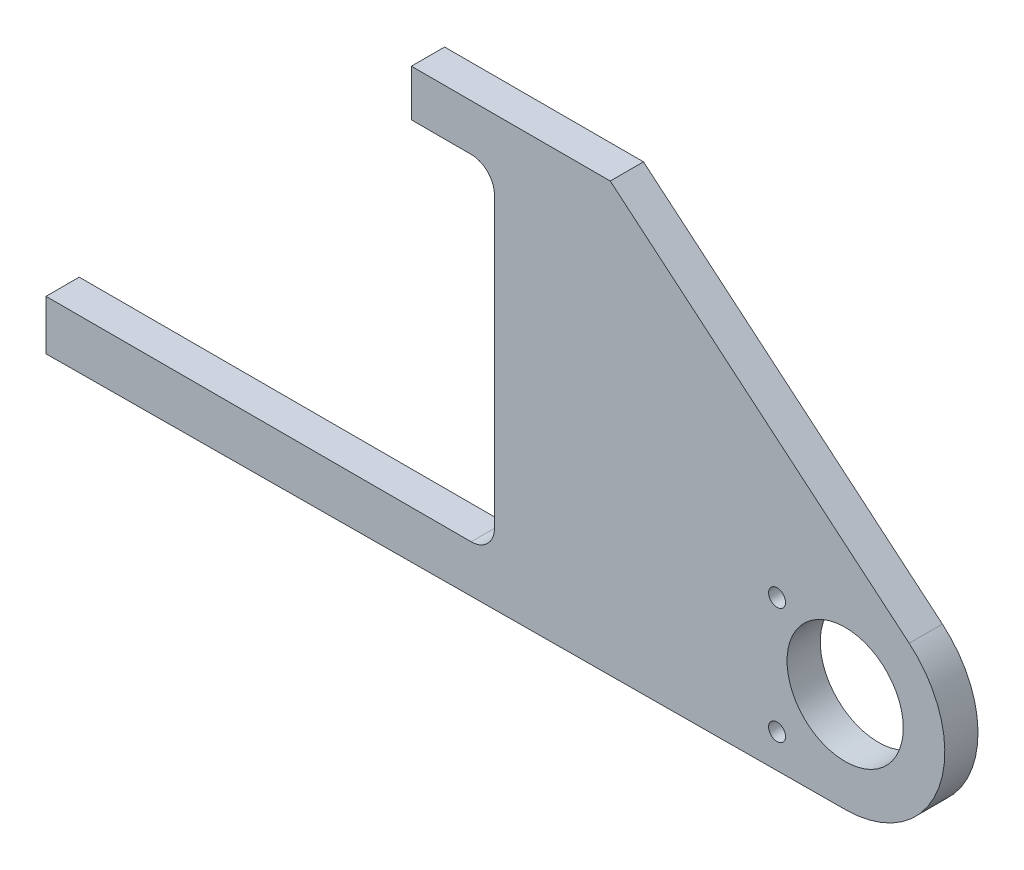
from build123d import *

# Parameters (mm, degrees)
ESQUISSE1_R            = 35
EXTRUSION1_DEPTH       = 20
TROU_TARAUD_M121_D     = 10.2
TROU_TARAUD_M121_DEPTH = 29.25
TROU_TARAUD_M121_TIP   = 3.064389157


with BuildPart() as part:
    # Esquisse1 → Extrusion1 (new body)
    with BuildSketch(Plane.XY):
        with BuildLine():
            Line((-481.18, -33), (-225.18, -33))
            ThreePointArc((-225.18, -33), (-215.280505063, -28.899494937), (-211.18, -19))
            Line((-211.18, -19), (-211.18, 155))
            ThreePointArc((-211.18, 155), (-215.280505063, 164.899494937), (-225.18, 169))
            Line((-225.18, 169), (-261.18, 169))
            Line((-261.18, 169), (-261.18, 197))
            Line((-261.18, 197), (-141.432028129, 197))
            Line((-141.432028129, 197), (38.567256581, 45.962666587))
            ThreePointArc((38.567256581, 45.962666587), (56.445229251, -20.345419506), (0.373927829, -59.998834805))
            Line((0.373927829, -59.998834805), (-481.18, -63))
            Line((-481.18, -63), (-481.18, -33))
        make_face()
        Circle(ESQUISSE1_R, mode=Mode.SUBTRACT)
    extrude(amount=EXTRUSION1_DEPTH)

    # Trou taraud_ M121
    with Locations(Plane.XY.offset(20)):
        with Locations((-41, 30), (-41, -40)):
            Hole(TROU_TARAUD_M121_D / 2, depth=TROU_TARAUD_M121_DEPTH)
            with Locations((0, 0, -(TROU_TARAUD_M121_DEPTH + TROU_TARAUD_M121_TIP / 2))):  # 118° drill point
                Cone(0, TROU_TARAUD_M121_D / 2, TROU_TARAUD_M121_TIP, mode=Mode.SUBTRACT)


solid = part.part
